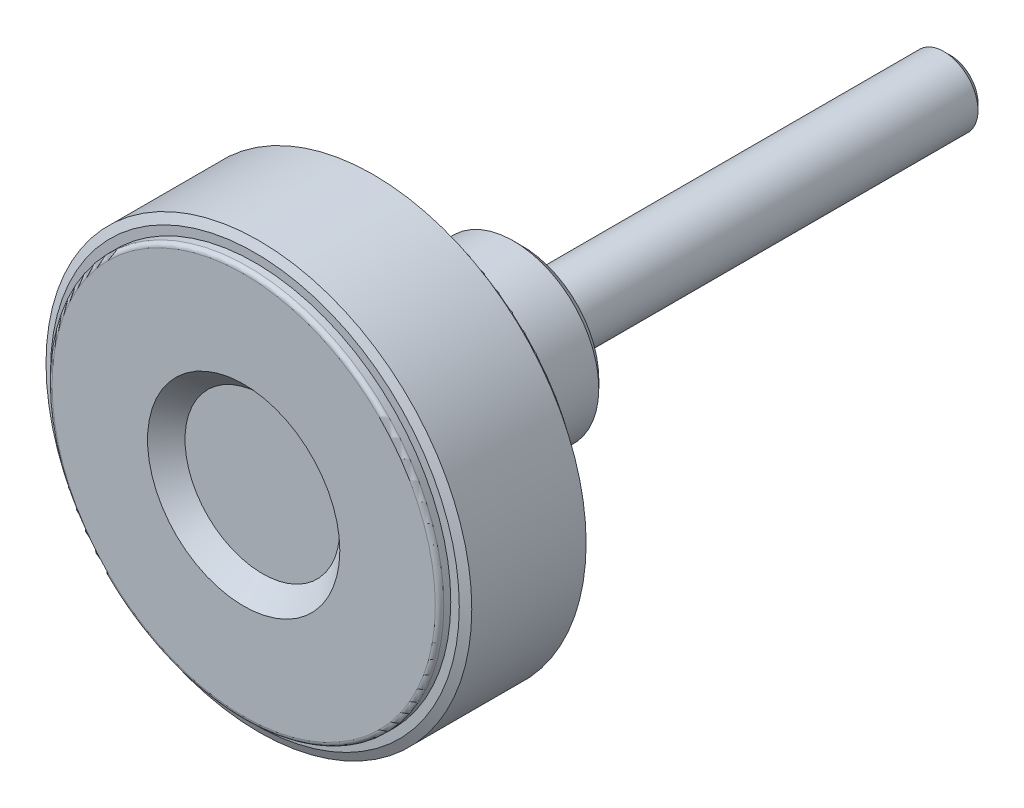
ISO-10303-21;
HEADER;
FILE_DESCRIPTION(('STEP AP214'),'2;1');
FILE_NAME('part.step','',(''),(''),'','','');
FILE_SCHEMA(('AUTOMOTIVE_DESIGN { 1 0 10303 214 1 1 1 1 }'));
ENDSEC;
DATA;
#1=APPLICATION_CONTEXT('core data for automotive mechanical design processes');
#2=APPLICATION_PROTOCOL_DEFINITION('international standard','automotive_design',2000,#1);
#3=PRODUCT_CONTEXT('',#1,'mechanical');
#4=PRODUCT('Part','Part','',(#3));
#5=PRODUCT_RELATED_PRODUCT_CATEGORY('part','',(#4));
#6=PRODUCT_DEFINITION_FORMATION('','',#4);
#7=PRODUCT_DEFINITION_CONTEXT('part definition',#1,'design');
#8=PRODUCT_DEFINITION('design','',#6,#7);
#9=PRODUCT_DEFINITION_SHAPE('','',#8);
#10=(LENGTH_UNIT() NAMED_UNIT(*) SI_UNIT(.MILLI.,.METRE.));
#11=(NAMED_UNIT(*) PLANE_ANGLE_UNIT() SI_UNIT($,.RADIAN.));
#12=(NAMED_UNIT(*) SI_UNIT($,.STERADIAN.) SOLID_ANGLE_UNIT());
#13=UNCERTAINTY_MEASURE_WITH_UNIT(LENGTH_MEASURE(1.E-05),#10,'distance_accuracy_value','');
#14=(GEOMETRIC_REPRESENTATION_CONTEXT(3) GLOBAL_UNCERTAINTY_ASSIGNED_CONTEXT((#13)) GLOBAL_UNIT_ASSIGNED_CONTEXT((#10,
#11,#12)) REPRESENTATION_CONTEXT('',''));
#15=CARTESIAN_POINT('',(0.,0.,0.));
#16=DIRECTION('',(0.,0.,1.));
#17=DIRECTION('',(1.,0.,0.));
#18=AXIS2_PLACEMENT_3D('',#15,#16,#17);
#19=CARTESIAN_POINT('',(0.,1.6165,-50.));
#20=DIRECTION('',(0.,0.,-1.));
#21=DIRECTION('',(-1.,0.,0.));
#22=AXIS2_PLACEMENT_3D('',#19,#20,#21);
#23=PLANE('',#22);
#24=CARTESIAN_POINT('',(0.,0.,-50.0000000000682));
#25=DIRECTION('',(0.,0.,1.));
#26=DIRECTION('',(1.,0.,0.));
#27=AXIS2_PLACEMENT_3D('',#24,#25,#26);
#28=CIRCLE('',#27,3.23300000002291);
#29=CARTESIAN_POINT('',(3.23300000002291,0.,-50.0000000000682));
#30=VERTEX_POINT('',#29);
#31=EDGE_CURVE('E179',#30,#30,#28,.T.);
#32=ORIENTED_EDGE('',*,*,#31,.F.);
#33=EDGE_LOOP('',(#32));
#34=FACE_BOUND('',#33,.T.);
#35=ADVANCED_FACE('F14',(#34),#23,.T.);
#36=CARTESIAN_POINT('',(0.,0.,-49.2330000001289));
#37=DIRECTION('',(0.,0.,1.));
#38=DIRECTION('',(1.,0.,0.));
#39=AXIS2_PLACEMENT_3D('',#36,#37,#38);
#40=CONICAL_SURFACE('',#39,3.99999999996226,0.785398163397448);
#41=ORIENTED_EDGE('',*,*,#31,.T.);
#42=EDGE_LOOP('',(#41));
#43=FACE_BOUND('',#42,.T.);
#44=CARTESIAN_POINT('',(0.,0.,-49.233));
#45=DIRECTION('',(0.,0.,1.));
#46=DIRECTION('',(1.,0.,0.));
#47=AXIS2_PLACEMENT_3D('',#44,#45,#46);
#48=CIRCLE('',#47,4.);
#49=CARTESIAN_POINT('',(4.,0.,-49.233));
#50=VERTEX_POINT('',#49);
#51=EDGE_CURVE('E176',#50,#50,#48,.T.);
#52=ORIENTED_EDGE('',*,*,#51,.F.);
#53=EDGE_LOOP('',(#52));
#54=FACE_BOUND('',#53,.T.);
#55=ADVANCED_FACE('F536',(#43,#54),#40,.T.);
#56=CARTESIAN_POINT('',(0.,0.,-24.1165));
#57=DIRECTION('',(0.,0.,1.));
#58=DIRECTION('',(1.,0.,0.));
#59=AXIS2_PLACEMENT_3D('',#56,#57,#58);
#60=CYLINDRICAL_SURFACE('',#59,4.);
#61=ORIENTED_EDGE('',*,*,#51,.T.);
#62=EDGE_LOOP('',(#61));
#63=FACE_BOUND('',#62,.T.);
#64=CARTESIAN_POINT('',(0.,0.,0.));
#65=DIRECTION('',(0.,0.,1.));
#66=DIRECTION('',(1.,0.,0.));
#67=AXIS2_PLACEMENT_3D('',#64,#65,#66);
#68=CIRCLE('',#67,4.);
#69=CARTESIAN_POINT('',(4.,0.,0.));
#70=VERTEX_POINT('',#69);
#71=EDGE_CURVE('E178',#70,#70,#68,.T.);
#72=ORIENTED_EDGE('',*,*,#71,.F.);
#73=EDGE_LOOP('',(#72));
#74=FACE_BOUND('',#73,.T.);
#75=ADVANCED_FACE('F526',(#63,#74),#60,.T.);
#76=CARTESIAN_POINT('',(0.,2.66666666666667,0.));
#77=DIRECTION('',(0.,0.,-1.));
#78=DIRECTION('',(-1.,0.,0.));
#79=AXIS2_PLACEMENT_3D('',#76,#77,#78);
#80=PLANE('',#79);
#81=CARTESIAN_POINT('',(0.,0.,0.));
#82=DIRECTION('',(0.,0.,1.));
#83=DIRECTION('',(1.,0.,0.));
#84=AXIS2_PLACEMENT_3D('',#81,#82,#83);
#85=CIRCLE('',#84,5.33333333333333);
#86=CARTESIAN_POINT('',(5.33333333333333,0.,0.));
#87=VERTEX_POINT('',#86);
#88=EDGE_CURVE('E211',#87,#87,#85,.T.);
#89=ORIENTED_EDGE('',*,*,#88,.F.);
#90=EDGE_LOOP('',(#89));
#91=FACE_BOUND('',#90,.T.);
#92=ORIENTED_EDGE('',*,*,#71,.T.);
#93=EDGE_LOOP('',(#92));
#94=FACE_BOUND('',#93,.T.);
#95=ADVANCED_FACE('F516',(#91,#94),#80,.T.);
#96=CARTESIAN_POINT('',(0.,0.,0.15));
#97=DIRECTION('',(0.,0.,1.));
#98=DIRECTION('',(1.,0.,0.));
#99=AXIS2_PLACEMENT_3D('',#96,#97,#98);
#100=CYLINDRICAL_SURFACE('',#99,5.33333333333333);
#101=ORIENTED_EDGE('',*,*,#88,.T.);
#102=EDGE_LOOP('',(#101));
#103=FACE_BOUND('',#102,.T.);
#104=CARTESIAN_POINT('',(0.,0.,0.3));
#105=DIRECTION('',(0.,0.,1.));
#106=DIRECTION('',(1.,0.,0.));
#107=AXIS2_PLACEMENT_3D('',#104,#105,#106);
#108=CIRCLE('',#107,5.33333333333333);
#109=CARTESIAN_POINT('',(5.33333333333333,0.,0.3));
#110=VERTEX_POINT('',#109);
#111=EDGE_CURVE('E208',#110,#110,#108,.T.);
#112=ORIENTED_EDGE('',*,*,#111,.F.);
#113=EDGE_LOOP('',(#112));
#114=FACE_BOUND('',#113,.T.);
#115=ADVANCED_FACE('F506',(#103,#114),#100,.T.);
#116=CARTESIAN_POINT('',(0.,7.16666666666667,0.3));
#117=DIRECTION('',(0.,0.,-1.));
#118=DIRECTION('',(-1.,0.,0.));
#119=AXIS2_PLACEMENT_3D('',#116,#117,#118);
#120=PLANE('',#119);
#121=CARTESIAN_POINT('',(0.,0.,0.3));
#122=DIRECTION('',(0.,0.,1.));
#123=DIRECTION('',(1.,0.,0.));
#124=AXIS2_PLACEMENT_3D('',#121,#122,#123);
#125=CIRCLE('',#124,9.);
#126=CARTESIAN_POINT('',(9.,0.,0.3));
#127=VERTEX_POINT('',#126);
#128=EDGE_CURVE('E175',#127,#127,#125,.T.);
#129=ORIENTED_EDGE('',*,*,#128,.F.);
#130=EDGE_LOOP('',(#129));
#131=FACE_BOUND('',#130,.T.);
#132=ORIENTED_EDGE('',*,*,#111,.T.);
#133=EDGE_LOOP('',(#132));
#134=FACE_BOUND('',#133,.T.);
#135=ADVANCED_FACE('F496',(#131,#134),#120,.T.);
#136=CARTESIAN_POINT('',(0.,0.,1.3));
#137=DIRECTION('',(0.,0.,1.));
#138=DIRECTION('',(1.,0.,0.));
#139=AXIS2_PLACEMENT_3D('',#136,#137,#138);
#140=CONICAL_SURFACE('',#139,10.,0.785398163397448);
#141=ORIENTED_EDGE('',*,*,#128,.T.);
#142=EDGE_LOOP('',(#141));
#143=FACE_BOUND('',#142,.T.);
#144=CARTESIAN_POINT('',(0.,0.,1.3));
#145=DIRECTION('',(0.,0.,1.));
#146=DIRECTION('',(1.,0.,0.));
#147=AXIS2_PLACEMENT_3D('',#144,#145,#146);
#148=CIRCLE('',#147,10.);
#149=CARTESIAN_POINT('',(10.,0.,1.3));
#150=VERTEX_POINT('',#149);
#151=EDGE_CURVE('E172',#150,#150,#148,.T.);
#152=ORIENTED_EDGE('',*,*,#151,.F.);
#153=EDGE_LOOP('',(#152));
#154=FACE_BOUND('',#153,.T.);
#155=ADVANCED_FACE('F487',(#143,#154),#140,.T.);
#156=CARTESIAN_POINT('',(0.,0.,13.9));
#157=DIRECTION('',(0.,0.,1.));
#158=DIRECTION('',(1.,0.,0.));
#159=AXIS2_PLACEMENT_3D('',#156,#157,#158);
#160=CYLINDRICAL_SURFACE('',#159,10.);
#161=ORIENTED_EDGE('',*,*,#151,.T.);
#162=EDGE_LOOP('',(#161));
#163=FACE_BOUND('',#162,.T.);
#164=CARTESIAN_POINT('',(0.,0.,26.5));
#165=DIRECTION('',(0.,0.,-1.));
#166=DIRECTION('',(-1.,0.,0.));
#167=AXIS2_PLACEMENT_3D('',#164,#165,#166);
#168=CIRCLE('',#167,10.);
#169=CARTESIAN_POINT('',(-10.,0.,26.5));
#170=VERTEX_POINT('',#169);
#171=EDGE_CURVE('E75',#170,#170,#168,.T.);
#172=ORIENTED_EDGE('',*,*,#171,.T.);
#173=EDGE_LOOP('',(#172));
#174=FACE_BOUND('',#173,.T.);
#175=ADVANCED_FACE('F482',(#163,#174),#160,.T.);
#176=CARTESIAN_POINT('',(0.,0.,26.5));
#177=DIRECTION('',(0.,0.,-1.));
#178=DIRECTION('',(-1.,0.,0.));
#179=AXIS2_PLACEMENT_3D('',#176,#177,#178);
#180=TOROIDAL_SURFACE('',#179,11.,1.);
#181=CARTESIAN_POINT('',(0.,0.,27.5));
#182=DIRECTION('',(0.,0.,-1.));
#183=DIRECTION('',(1.,0.,0.));
#184=AXIS2_PLACEMENT_3D('',#181,#182,#183);
#185=CIRCLE('',#184,11.);
#186=CARTESIAN_POINT('',(-11.,0.,27.5));
#187=VERTEX_POINT('',#186);
#188=CARTESIAN_POINT('',(11.,0.,27.5));
#189=VERTEX_POINT('',#188);
#190=EDGE_CURVE('E68',#187,#189,#185,.F.);
#191=ORIENTED_EDGE('',*,*,#190,.F.);
#192=CARTESIAN_POINT('',(0.,0.,27.5));
#193=DIRECTION('',(0.,0.,-1.));
#194=DIRECTION('',(-1.,0.,0.));
#195=AXIS2_PLACEMENT_3D('',#192,#193,#194);
#196=CIRCLE('',#195,11.);
#197=CARTESIAN_POINT('',(0.,11.,27.5));
#198=VERTEX_POINT('',#197);
#199=EDGE_CURVE('E71',#198,#187,#196,.F.);
#200=ORIENTED_EDGE('',*,*,#199,.F.);
#201=CARTESIAN_POINT('',(0.,0.,27.5));
#202=DIRECTION('',(0.,0.,-1.));
#203=DIRECTION('',(0.,1.,0.));
#204=AXIS2_PLACEMENT_3D('',#201,#202,#203);
#205=CIRCLE('',#204,11.);
#206=EDGE_CURVE('E63',#189,#198,#205,.F.);
#207=ORIENTED_EDGE('',*,*,#206,.F.);
#208=EDGE_LOOP('',(#191,#200,#207));
#209=FACE_BOUND('',#208,.T.);
#210=ORIENTED_EDGE('',*,*,#171,.F.);
#211=EDGE_LOOP('',(#210));
#212=FACE_BOUND('',#211,.T.);
#213=ADVANCED_FACE('F66',(#209,#212),#180,.F.);
#214=CARTESIAN_POINT('',(0.,14.6153846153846,27.5));
#215=DIRECTION('',(0.,0.,-1.));
#216=DIRECTION('',(-1.,0.,0.));
#217=AXIS2_PLACEMENT_3D('',#214,#215,#216);
#218=PLANE('',#217);
#219=CARTESIAN_POINT('',(0.,0.,27.5));
#220=DIRECTION('',(0.,0.,1.));
#221=DIRECTION('',(-1.,0.,0.));
#222=AXIS2_PLACEMENT_3D('',#219,#220,#221);
#223=CIRCLE('',#222,18.2307692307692);
#224=CARTESIAN_POINT('',(18.2307692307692,0.,27.5));
#225=VERTEX_POINT('',#224);
#226=CARTESIAN_POINT('',(-18.2307692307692,0.,27.5));
#227=VERTEX_POINT('',#226);
#228=EDGE_CURVE('E81',#225,#227,#223,.F.);
#229=ORIENTED_EDGE('',*,*,#228,.T.);
#230=CARTESIAN_POINT('',(0.,0.,27.5));
#231=DIRECTION('',(0.,0.,1.));
#232=DIRECTION('',(0.,1.,0.));
#233=AXIS2_PLACEMENT_3D('',#230,#231,#232);
#234=CIRCLE('',#233,18.2307692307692);
#235=CARTESIAN_POINT('',(0.,18.2307692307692,27.5));
#236=VERTEX_POINT('',#235);
#237=EDGE_CURVE('E130',#227,#236,#234,.F.);
#238=ORIENTED_EDGE('',*,*,#237,.T.);
#239=CARTESIAN_POINT('',(0.,0.,27.5));
#240=DIRECTION('',(0.,0.,1.));
#241=DIRECTION('',(1.,0.,0.));
#242=AXIS2_PLACEMENT_3D('',#239,#240,#241);
#243=CIRCLE('',#242,18.2307692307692);
#244=EDGE_CURVE('E143',#236,#225,#243,.F.);
#245=ORIENTED_EDGE('',*,*,#244,.T.);
#246=EDGE_LOOP('',(#229,#238,#245));
#247=FACE_BOUND('',#246,.T.);
#248=ORIENTED_EDGE('',*,*,#199,.T.);
#249=ORIENTED_EDGE('',*,*,#190,.T.);
#250=ORIENTED_EDGE('',*,*,#206,.T.);
#251=EDGE_LOOP('',(#248,#249,#250));
#252=FACE_BOUND('',#251,.T.);
#253=ADVANCED_FACE('F79',(#247,#252),#218,.T.);
#254=CARTESIAN_POINT('',(0.,0.,26.5));
#255=DIRECTION('',(0.,0.,-1.));
#256=DIRECTION('',(-1.,0.,0.));
#257=AXIS2_PLACEMENT_3D('',#254,#255,#256);
#258=TOROIDAL_SURFACE('',#257,18.2307692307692,1.);
#259=ORIENTED_EDGE('',*,*,#237,.F.);
#260=ORIENTED_EDGE('',*,*,#228,.F.);
#261=ORIENTED_EDGE('',*,*,#244,.F.);
#262=EDGE_LOOP('',(#259,#260,#261));
#263=FACE_BOUND('',#262,.T.);
#264=CARTESIAN_POINT('',(0.,0.,26.5));
#265=DIRECTION('',(0.,0.,1.));
#266=DIRECTION('',(1.,0.,0.));
#267=AXIS2_PLACEMENT_3D('',#264,#265,#266);
#268=CIRCLE('',#267,19.2307692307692);
#269=CARTESIAN_POINT('',(19.2307692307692,0.,26.5));
#270=VERTEX_POINT('',#269);
#271=EDGE_CURVE('E205',#270,#270,#268,.F.);
#272=ORIENTED_EDGE('',*,*,#271,.T.);
#273=EDGE_LOOP('',(#272));
#274=FACE_BOUND('',#273,.T.);
#275=ADVANCED_FACE('F100',(#263,#274),#258,.F.);
#276=CARTESIAN_POINT('',(0.,0.,21.25));
#277=DIRECTION('',(0.,0.,1.));
#278=DIRECTION('',(1.,0.,0.));
#279=AXIS2_PLACEMENT_3D('',#276,#277,#278);
#280=CYLINDRICAL_SURFACE('',#279,19.2307692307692);
#281=ORIENTED_EDGE('',*,*,#271,.F.);
#282=EDGE_LOOP('',(#281));
#283=FACE_BOUND('',#282,.T.);
#284=CARTESIAN_POINT('',(0.,0.,16.));
#285=DIRECTION('',(0.,0.,1.));
#286=DIRECTION('',(1.,0.,0.));
#287=AXIS2_PLACEMENT_3D('',#284,#285,#286);
#288=CIRCLE('',#287,19.2307692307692);
#289=CARTESIAN_POINT('',(19.2307692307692,0.,16.));
#290=VERTEX_POINT('',#289);
#291=EDGE_CURVE('E201',#290,#290,#288,.T.);
#292=ORIENTED_EDGE('',*,*,#291,.F.);
#293=EDGE_LOOP('',(#292));
#294=FACE_BOUND('',#293,.T.);
#295=ADVANCED_FACE('F329',(#283,#294),#280,.F.);
#296=CARTESIAN_POINT('',(0.,20.8653846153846,16.));
#297=DIRECTION('',(0.,0.,-1.));
#298=DIRECTION('',(-1.,0.,0.));
#299=AXIS2_PLACEMENT_3D('',#296,#297,#298);
#300=PLANE('',#299);
#301=CARTESIAN_POINT('',(0.,0.,16.));
#302=DIRECTION('',(0.,0.,1.));
#303=DIRECTION('',(-1.,0.,0.));
#304=AXIS2_PLACEMENT_3D('',#301,#302,#303);
#305=CIRCLE('',#304,22.5);
#306=CARTESIAN_POINT('',(-22.5,0.,16.));
#307=VERTEX_POINT('',#306);
#308=CARTESIAN_POINT('',(22.5,0.,16.));
#309=VERTEX_POINT('',#308);
#310=EDGE_CURVE('E264',#307,#309,#305,.T.);
#311=ORIENTED_EDGE('',*,*,#310,.F.);
#312=CARTESIAN_POINT('',(0.,0.,16.));
#313=DIRECTION('',(0.,0.,1.));
#314=DIRECTION('',(0.,1.,0.));
#315=AXIS2_PLACEMENT_3D('',#312,#313,#314);
#316=CIRCLE('',#315,22.5);
#317=CARTESIAN_POINT('',(0.,22.5,16.));
#318=VERTEX_POINT('',#317);
#319=EDGE_CURVE('E299',#318,#307,#316,.T.);
#320=ORIENTED_EDGE('',*,*,#319,.F.);
#321=CARTESIAN_POINT('',(0.,0.,16.));
#322=DIRECTION('',(0.,0.,1.));
#323=DIRECTION('',(1.,0.,0.));
#324=AXIS2_PLACEMENT_3D('',#321,#322,#323);
#325=CIRCLE('',#324,22.5);
#326=EDGE_CURVE('E204',#309,#318,#325,.T.);
#327=ORIENTED_EDGE('',*,*,#326,.F.);
#328=EDGE_LOOP('',(#311,#320,#327));
#329=FACE_BOUND('',#328,.T.);
#330=ORIENTED_EDGE('',*,*,#291,.T.);
#331=EDGE_LOOP('',(#330));
#332=FACE_BOUND('',#331,.T.);
#333=ADVANCED_FACE('F275',(#329,#332),#300,.T.);
#334=CARTESIAN_POINT('',(0.,0.,16.5));
#335=DIRECTION('',(0.,0.,-1.));
#336=DIRECTION('',(-1.,0.,0.));
#337=AXIS2_PLACEMENT_3D('',#334,#335,#336);
#338=TOROIDAL_SURFACE('',#337,22.5,0.5);
#339=ORIENTED_EDGE('',*,*,#319,.T.);
#340=ORIENTED_EDGE('',*,*,#310,.T.);
#341=ORIENTED_EDGE('',*,*,#326,.T.);
#342=EDGE_LOOP('',(#339,#340,#341));
#343=FACE_BOUND('',#342,.T.);
#344=CARTESIAN_POINT('',(0.,0.,16.5));
#345=DIRECTION('',(0.,0.,1.));
#346=DIRECTION('',(1.,0.,0.));
#347=AXIS2_PLACEMENT_3D('',#344,#345,#346);
#348=CIRCLE('',#347,23.);
#349=CARTESIAN_POINT('',(23.,0.,16.5));
#350=VERTEX_POINT('',#349);
#351=EDGE_CURVE('E200',#350,#350,#348,.T.);
#352=ORIENTED_EDGE('',*,*,#351,.F.);
#353=EDGE_LOOP('',(#352));
#354=FACE_BOUND('',#353,.T.);
#355=ADVANCED_FACE('F269',(#343,#354),#338,.T.);
#356=CARTESIAN_POINT('',(0.,0.,16.91));
#357=DIRECTION('',(0.,0.,1.));
#358=DIRECTION('',(1.,0.,0.));
#359=AXIS2_PLACEMENT_3D('',#356,#357,#358);
#360=CYLINDRICAL_SURFACE('',#359,23.);
#361=ORIENTED_EDGE('',*,*,#351,.T.);
#362=EDGE_LOOP('',(#361));
#363=FACE_BOUND('',#362,.T.);
#364=CARTESIAN_POINT('',(0.,0.,17.32));
#365=DIRECTION('',(0.,0.,1.));
#366=DIRECTION('',(1.,0.,0.));
#367=AXIS2_PLACEMENT_3D('',#364,#365,#366);
#368=CIRCLE('',#367,23.);
#369=CARTESIAN_POINT('',(23.,0.,17.32));
#370=VERTEX_POINT('',#369);
#371=EDGE_CURVE('E197',#370,#370,#368,.T.);
#372=ORIENTED_EDGE('',*,*,#371,.F.);
#373=EDGE_LOOP('',(#372));
#374=FACE_BOUND('',#373,.T.);
#375=ADVANCED_FACE('F274',(#363,#374),#360,.T.);
#376=CARTESIAN_POINT('',(0.,23.5,17.32));
#377=DIRECTION('',(0.,0.,-1.));
#378=DIRECTION('',(-1.,0.,0.));
#379=AXIS2_PLACEMENT_3D('',#376,#377,#378);
#380=PLANE('',#379);
#381=CARTESIAN_POINT('',(0.,0.,17.32));
#382=DIRECTION('',(0.,0.,1.));
#383=DIRECTION('',(1.,0.,0.));
#384=AXIS2_PLACEMENT_3D('',#381,#382,#383);
#385=CIRCLE('',#384,24.);
#386=CARTESIAN_POINT('',(24.,0.,17.32));
#387=VERTEX_POINT('',#386);
#388=EDGE_CURVE('E193',#387,#387,#385,.T.);
#389=ORIENTED_EDGE('',*,*,#388,.F.);
#390=EDGE_LOOP('',(#389));
#391=FACE_BOUND('',#390,.T.);
#392=ORIENTED_EDGE('',*,*,#371,.T.);
#393=EDGE_LOOP('',(#392));
#394=FACE_BOUND('',#393,.T.);
#395=ADVANCED_FACE('F342',(#391,#394),#380,.T.);
#396=CARTESIAN_POINT('',(0.,0.,17.786307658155));
#397=DIRECTION('',(0.,0.,1.));
#398=DIRECTION('',(1.,0.,0.));
#399=AXIS2_PLACEMENT_3D('',#396,#397,#398);
#400=CONICAL_SURFACE('',#399,25.,1.13446401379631);
#401=CARTESIAN_POINT('',(4.86721773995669E-13,1.73372427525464E-12,17.786307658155));
#402=DIRECTION('',(0.,0.,-1.));
#403=DIRECTION('',(-1.,0.,0.));
#404=AXIS2_PLACEMENT_3D('',#401,#402,#403);
#405=CIRCLE('',#404,24.9999999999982);
#406=CARTESIAN_POINT('',(-24.9999999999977,1.73372427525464E-12,17.786307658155));
#407=VERTEX_POINT('',#406);
#408=EDGE_CURVE('E196',#407,#407,#405,.F.);
#409=ORIENTED_EDGE('',*,*,#408,.F.);
#410=EDGE_LOOP('',(#409));
#411=FACE_BOUND('',#410,.T.);
#412=ORIENTED_EDGE('',*,*,#388,.T.);
#413=EDGE_LOOP('',(#412));
#414=FACE_BOUND('',#413,.T.);
#415=ADVANCED_FACE('F340',(#411,#414),#400,.T.);
#416=CARTESIAN_POINT('',(0.,4.54545454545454,30.8));
#417=DIRECTION('',(0.,0.,1.));
#418=DIRECTION('',(1.,0.,0.));
#419=AXIS2_PLACEMENT_3D('',#416,#417,#418);
#420=PLANE('',#419);
#421=CARTESIAN_POINT('',(0.,0.,30.8));
#422=DIRECTION('',(0.,0.,1.));
#423=DIRECTION('',(1.,0.,0.));
#424=AXIS2_PLACEMENT_3D('',#421,#422,#423);
#425=CIRCLE('',#424,9.0909090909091);
#426=CARTESIAN_POINT('',(9.0909090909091,0.,30.8));
#427=VERTEX_POINT('',#426);
#428=EDGE_CURVE('E181',#427,#427,#425,.T.);
#429=ORIENTED_EDGE('',*,*,#428,.T.);
#430=EDGE_LOOP('',(#429));
#431=FACE_BOUND('',#430,.T.);
#432=ADVANCED_FACE('F242',(#431),#420,.T.);
#433=CARTESIAN_POINT('',(0.,0.,33.));
#434=DIRECTION('',(0.,0.,1.));
#435=DIRECTION('',(1.,0.,0.));
#436=AXIS2_PLACEMENT_3D('',#433,#434,#435);
#437=CONICAL_SURFACE('',#436,11.2909090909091,0.785398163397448);
#438=CARTESIAN_POINT('',(0.,0.,33.));
#439=DIRECTION('',(0.,0.,1.));
#440=DIRECTION('',(1.,0.,0.));
#441=AXIS2_PLACEMENT_3D('',#438,#439,#440);
#442=CIRCLE('',#441,11.2909090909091);
#443=CARTESIAN_POINT('',(11.2909090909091,0.,33.));
#444=VERTEX_POINT('',#443);
#445=EDGE_CURVE('E9',#444,#444,#442,.F.);
#446=ORIENTED_EDGE('',*,*,#445,.F.);
#447=EDGE_LOOP('',(#446));
#448=FACE_BOUND('',#447,.T.);
#449=ORIENTED_EDGE('',*,*,#428,.F.);
#450=EDGE_LOOP('',(#449));
#451=FACE_BOUND('',#450,.T.);
#452=ADVANCED_FACE('F240',(#448,#451),#437,.F.);
#453=CARTESIAN_POINT('',(0.,16.8954545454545,33.));
#454=DIRECTION('',(0.,0.,1.));
#455=DIRECTION('',(1.,0.,0.));
#456=AXIS2_PLACEMENT_3D('',#453,#454,#455);
#457=PLANE('',#456);
#458=ORIENTED_EDGE('',*,*,#445,.T.);
#459=EDGE_LOOP('',(#458));
#460=FACE_BOUND('',#459,.T.);
#461=CARTESIAN_POINT('',(0.,0.,33.));
#462=DIRECTION('',(0.,0.,-1.));
#463=DIRECTION('',(-1.,0.,0.));
#464=AXIS2_PLACEMENT_3D('',#461,#462,#463);
#465=CIRCLE('',#464,22.5);
#466=CARTESIAN_POINT('',(0.,22.5,33.));
#467=VERTEX_POINT('',#466);
#468=CARTESIAN_POINT('',(-22.5,0.,33.));
#469=VERTEX_POINT('',#468);
#470=EDGE_CURVE('E219',#467,#469,#465,.F.);
#471=ORIENTED_EDGE('',*,*,#470,.T.);
#472=CARTESIAN_POINT('',(0.,0.,33.));
#473=DIRECTION('',(0.,0.,-1.));
#474=DIRECTION('',(1.,0.,0.));
#475=AXIS2_PLACEMENT_3D('',#472,#473,#474);
#476=CIRCLE('',#475,22.5);
#477=CARTESIAN_POINT('',(22.5,0.,33.));
#478=VERTEX_POINT('',#477);
#479=EDGE_CURVE('E23',#469,#478,#476,.F.);
#480=ORIENTED_EDGE('',*,*,#479,.T.);
#481=CARTESIAN_POINT('',(0.,0.,33.));
#482=DIRECTION('',(0.,0.,-1.));
#483=DIRECTION('',(0.,1.,0.));
#484=AXIS2_PLACEMENT_3D('',#481,#482,#483);
#485=CIRCLE('',#484,22.5);
#486=EDGE_CURVE('E184',#478,#467,#485,.F.);
#487=ORIENTED_EDGE('',*,*,#486,.T.);
#488=EDGE_LOOP('',(#471,#480,#487));
#489=FACE_BOUND('',#488,.T.);
#490=ADVANCED_FACE('F238',(#460,#489),#457,.T.);
#491=CARTESIAN_POINT('',(0.,0.,32.5));
#492=DIRECTION('',(0.,0.,-1.));
#493=DIRECTION('',(-1.,0.,0.));
#494=AXIS2_PLACEMENT_3D('',#491,#492,#493);
#495=TOROIDAL_SURFACE('',#494,22.5,0.5);
#496=CARTESIAN_POINT('',(0.,0.,32.5));
#497=DIRECTION('',(0.,0.,-1.));
#498=DIRECTION('',(-1.,0.,0.));
#499=AXIS2_PLACEMENT_3D('',#496,#497,#498);
#500=CIRCLE('',#499,23.);
#501=CARTESIAN_POINT('',(-23.,0.,32.5));
#502=VERTEX_POINT('',#501);
#503=EDGE_CURVE('E185',#502,#502,#500,.F.);
#504=ORIENTED_EDGE('',*,*,#503,.T.);
#505=EDGE_LOOP('',(#504));
#506=FACE_BOUND('',#505,.T.);
#507=ORIENTED_EDGE('',*,*,#479,.F.);
#508=ORIENTED_EDGE('',*,*,#470,.F.);
#509=ORIENTED_EDGE('',*,*,#486,.F.);
#510=EDGE_LOOP('',(#507,#508,#509));
#511=FACE_BOUND('',#510,.T.);
#512=ADVANCED_FACE('F226',(#506,#511),#495,.T.);
#513=CARTESIAN_POINT('',(0.,0.,32.09));
#514=DIRECTION('',(0.,0.,1.));
#515=DIRECTION('',(1.,0.,0.));
#516=AXIS2_PLACEMENT_3D('',#513,#514,#515);
#517=CYLINDRICAL_SURFACE('',#516,23.);
#518=ORIENTED_EDGE('',*,*,#503,.F.);
#519=EDGE_LOOP('',(#518));
#520=FACE_BOUND('',#519,.T.);
#521=CARTESIAN_POINT('',(0.,0.,31.68));
#522=DIRECTION('',(0.,0.,1.));
#523=DIRECTION('',(1.,0.,0.));
#524=AXIS2_PLACEMENT_3D('',#521,#522,#523);
#525=CIRCLE('',#524,23.);
#526=CARTESIAN_POINT('',(23.,0.,31.68));
#527=VERTEX_POINT('',#526);
#528=EDGE_CURVE('E186',#527,#527,#525,.T.);
#529=ORIENTED_EDGE('',*,*,#528,.T.);
#530=EDGE_LOOP('',(#529));
#531=FACE_BOUND('',#530,.T.);
#532=ADVANCED_FACE('F237',(#520,#531),#517,.T.);
#533=CARTESIAN_POINT('',(0.,0.,31.213692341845));
#534=DIRECTION('',(0.,0.,-1.));
#535=DIRECTION('',(-1.,0.,0.));
#536=AXIS2_PLACEMENT_3D('',#533,#534,#535);
#537=CONICAL_SURFACE('',#536,25.,1.13446401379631);
#538=CARTESIAN_POINT('',(0.,0.,31.68));
#539=DIRECTION('',(0.,0.,-1.));
#540=DIRECTION('',(-1.,0.,0.));
#541=AXIS2_PLACEMENT_3D('',#538,#539,#540);
#542=CIRCLE('',#541,24.);
#543=CARTESIAN_POINT('',(-24.,0.,31.68));
#544=VERTEX_POINT('',#543);
#545=EDGE_CURVE('E189',#544,#544,#542,.F.);
#546=ORIENTED_EDGE('',*,*,#545,.F.);
#547=EDGE_LOOP('',(#546));
#548=FACE_BOUND('',#547,.T.);
#549=CARTESIAN_POINT('',(0.,0.,31.213692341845));
#550=DIRECTION('',(0.,0.,-1.));
#551=DIRECTION('',(0.,1.,0.));
#552=AXIS2_PLACEMENT_3D('',#549,#550,#551);
#553=CIRCLE('',#552,25.);
#554=CARTESIAN_POINT('',(0.,25.,31.213692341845));
#555=VERTEX_POINT('',#554);
#556=EDGE_CURVE('E192',#555,#555,#553,.F.);
#557=ORIENTED_EDGE('',*,*,#556,.T.);
#558=EDGE_LOOP('',(#557));
#559=FACE_BOUND('',#558,.T.);
#560=ADVANCED_FACE('F360',(#548,#559),#537,.T.);
#561=CARTESIAN_POINT('',(0.,23.5,31.68));
#562=DIRECTION('',(0.,0.,1.));
#563=DIRECTION('',(1.,0.,0.));
#564=AXIS2_PLACEMENT_3D('',#561,#562,#563);
#565=PLANE('',#564);
#566=ORIENTED_EDGE('',*,*,#528,.F.);
#567=EDGE_LOOP('',(#566));
#568=FACE_BOUND('',#567,.T.);
#569=ORIENTED_EDGE('',*,*,#545,.T.);
#570=EDGE_LOOP('',(#569));
#571=FACE_BOUND('',#570,.T.);
#572=ADVANCED_FACE('F358',(#568,#571),#565,.T.);
#573=CARTESIAN_POINT('',(4.86721773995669E-13,1.73372427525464E-12,0.));
#574=DIRECTION('',(0.,0.,-1.));
#575=DIRECTION('',(-1.,0.,0.));
#576=AXIS2_PLACEMENT_3D('',#573,#574,#575);
#577=CYLINDRICAL_SURFACE('',#576,24.9999999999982);
#578=ORIENTED_EDGE('',*,*,#408,.T.);
#579=EDGE_LOOP('',(#578));
#580=FACE_BOUND('',#579,.T.);
#581=ORIENTED_EDGE('',*,*,#556,.F.);
#582=EDGE_LOOP('',(#581));
#583=FACE_BOUND('',#582,.T.);
#584=ADVANCED_FACE('F355',(#580,#583),#577,.T.);
#585=CLOSED_SHELL('',(#35,#55,#75,#95,#115,#135,#155,#175,#213,#253,#275,#295,#333,#355,#375,
#395,#415,#432,#452,#490,#512,#532,#560,#572,#584));
#586=MANIFOLD_SOLID_BREP('B1',#585);
#587=ADVANCED_BREP_SHAPE_REPRESENTATION('',(#18,#586),#14);
#588=SHAPE_DEFINITION_REPRESENTATION(#9,#587);
ENDSEC;
END-ISO-10303-21;
